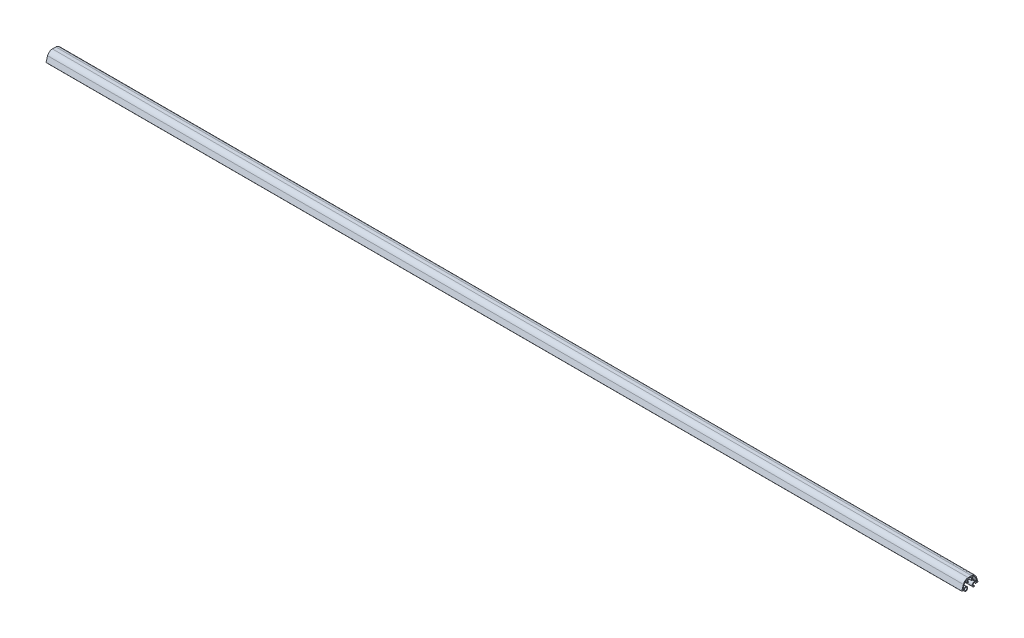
from build123d import *

# Parameters (mm, degrees)
BOSS_EXTRU_1_DEPTH = 1087


with BuildPart() as part:
    # Esquisse1 → Boss.-Extru.1 (new body)
    with BuildSketch(Plane(origin=(0, 0, 0), x_dir=(0, 0, -1), z_dir=(1, 0, 0))):
        with BuildLine():
            Line((7.707953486, 1.84912601), (9.615240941, -4.038362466))
            ThreePointArc((9.615240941, -4.038362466), (9.58672796, -4.217627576), (9.424975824, -4.3))
            Line((9.424975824, -4.3), (7.6, -4.3))
            Line((7.6, -4.3), (6.788194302, -4.3))
            ThreePointArc((6.788194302, -4.3), (6.655352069, -4.249509), (6.589583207, -4.123529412))
            ThreePointArc((6.589583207, -4.123529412), (3.942727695, -3.345683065), (5.210481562, -5.795925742))
            ThreePointArc((5.210481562, -5.795925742), (5.467652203, -5.865979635), (5.623713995, -6.082056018))
            Line((5.623713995, -6.082056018), (5.68127159, -6.27790883))
            ThreePointArc((5.68127159, -6.27790883), (5.628673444, -6.615023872), (5.335120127, -6.788919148))
            ThreePointArc((5.335120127, -6.788919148), (2.889950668, -3.131376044), (7.289383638, -3.093103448))
            ThreePointArc((7.289383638, -3.093103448), (7.436265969, -3.244413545), (7.63968502, -3.3))
            Line((7.63968502, -3.3), (7.858431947, -3.3))
            ThreePointArc((7.858431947, -3.3), (8.183976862, -3.132423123), (8.236752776, -2.77010254))
            Line((8.236752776, -2.77010254), (6.698463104, 1.710100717))
            ThreePointArc((6.698463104, 1.710100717), (5.174895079, 3.862646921), (2.768107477, 4.940648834))
            ThreePointArc((2.768107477, 4.940648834), (2.568597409, 4.850313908), (2.571481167, 4.631324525))
            ThreePointArc((2.571481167, 4.631324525), (3.099995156, 2.90548004), (2.5775862, 1.177777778))
            ThreePointArc((2.5775862, 1.177777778), (2.43355624, 1.047233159), (2.244994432, 1))
            Line((2.244994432, 1), (2, 1))
            ThreePointArc((2, 1), (1.642229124, 1.221114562), (1.68, 1.64))
            ThreePointArc((1.68, 1.64), (0, 5), (-1.68, 1.64))
            ThreePointArc((-1.68, 1.64), (-1.642229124, 1.221114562), (-2, 1))
            Line((-2, 1), (-2.244994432, 1))
            ThreePointArc((-2.244994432, 1), (-2.43355624, 1.047233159), (-2.5775862, 1.177777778))
            ThreePointArc((-2.5775862, 1.177777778), (-3.099995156, 2.90548004), (-2.571481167, 4.631324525))
            ThreePointArc((-2.571481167, 4.631324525), (-2.568597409, 4.850313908), (-2.768107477, 4.940648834))
            ThreePointArc((-2.768107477, 4.940648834), (-5.174895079, 3.862646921), (-6.698463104, 1.710100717))
            Line((-6.698463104, 1.710100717), (-8.236752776, -2.77010254))
            ThreePointArc((-8.236752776, -2.77010254), (-8.183976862, -3.132423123), (-7.858431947, -3.3))
            Line((-7.858431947, -3.3), (-7.63968502, -3.3))
            ThreePointArc((-7.63968502, -3.3), (-7.436265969, -3.244413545), (-7.289383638, -3.093103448))
            ThreePointArc((-7.289383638, -3.093103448), (-2.889950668, -3.131376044), (-5.335120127, -6.788919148))
            ThreePointArc((-5.335120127, -6.788919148), (-5.628673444, -6.615023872), (-5.68127159, -6.27790883))
            Line((-5.68127159, -6.27790883), (-5.623713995, -6.082056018))
            ThreePointArc((-5.623713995, -6.082056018), (-5.467652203, -5.865979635), (-5.210481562, -5.795925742))
            ThreePointArc((-5.210481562, -5.795925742), (-3.942727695, -3.345683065), (-6.589583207, -4.123529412))
            ThreePointArc((-6.589583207, -4.123529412), (-6.655352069, -4.249509), (-6.788194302, -4.3))
            Line((-6.788194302, -4.3), (-7.6, -4.3))
            Line((-7.6, -4.3), (-9.424975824, -4.3))
            ThreePointArc((-9.424975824, -4.3), (-9.58672796, -4.217627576), (-9.615240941, -4.038362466))
            Line((-9.615240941, -4.038362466), (-7.707953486, 1.84912601))
            ThreePointArc((-7.707953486, 1.84912601), (-5.52882728, 4.852564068), (-2, 6))
            Line((-2, 6), (2, 6))
            ThreePointArc((2, 6), (5.52882728, 4.852564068), (7.707953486, 1.84912601))
        make_face()
    extrude(amount=BOSS_EXTRU_1_DEPTH)


solid = part.part
